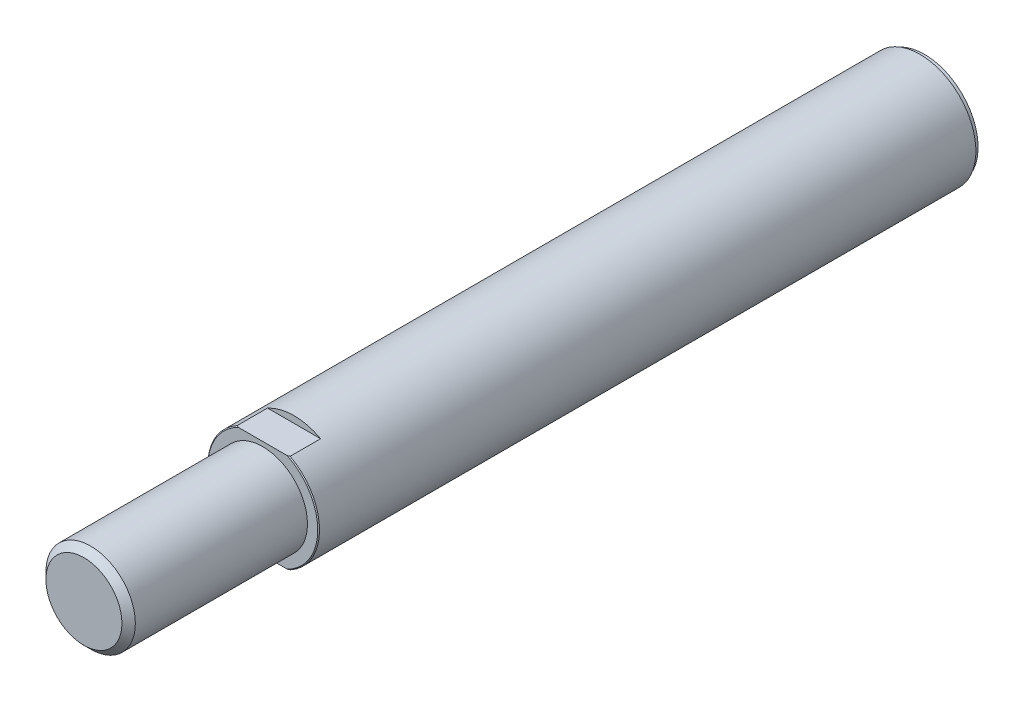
ISO-10303-21;
HEADER;
FILE_DESCRIPTION(('STEP AP214'),'2;1');
FILE_NAME('part.step','',(''),(''),'','','');
FILE_SCHEMA(('AUTOMOTIVE_DESIGN { 1 0 10303 214 1 1 1 1 }'));
ENDSEC;
DATA;
#1=APPLICATION_CONTEXT('core data for automotive mechanical design processes');
#2=APPLICATION_PROTOCOL_DEFINITION('international standard','automotive_design',2000,#1);
#3=PRODUCT_CONTEXT('',#1,'mechanical');
#4=PRODUCT('Part','Part','',(#3));
#5=PRODUCT_RELATED_PRODUCT_CATEGORY('part','',(#4));
#6=PRODUCT_DEFINITION_FORMATION('','',#4);
#7=PRODUCT_DEFINITION_CONTEXT('part definition',#1,'design');
#8=PRODUCT_DEFINITION('design','',#6,#7);
#9=PRODUCT_DEFINITION_SHAPE('','',#8);
#10=(LENGTH_UNIT() NAMED_UNIT(*) SI_UNIT(.MILLI.,.METRE.));
#11=(NAMED_UNIT(*) PLANE_ANGLE_UNIT() SI_UNIT($,.RADIAN.));
#12=(NAMED_UNIT(*) SI_UNIT($,.STERADIAN.) SOLID_ANGLE_UNIT());
#13=UNCERTAINTY_MEASURE_WITH_UNIT(LENGTH_MEASURE(1.E-05),#10,'distance_accuracy_value','');
#14=(GEOMETRIC_REPRESENTATION_CONTEXT(3) GLOBAL_UNCERTAINTY_ASSIGNED_CONTEXT((#13)) GLOBAL_UNIT_ASSIGNED_CONTEXT((#10,
#11,#12)) REPRESENTATION_CONTEXT('',''));
#15=CARTESIAN_POINT('',(0.,0.,0.));
#16=DIRECTION('',(0.,0.,1.));
#17=DIRECTION('',(1.,0.,0.));
#18=AXIS2_PLACEMENT_3D('',#15,#16,#17);
#19=CARTESIAN_POINT('',(0.,0.,188.));
#20=DIRECTION('',(0.,0.,-1.));
#21=DIRECTION('',(-1.,0.,0.));
#22=AXIS2_PLACEMENT_3D('',#19,#20,#21);
#23=CYLINDRICAL_SURFACE('',#22,12.5);
#24=DIRECTION('',(0.,0.,-1.));
#25=VECTOR('',#24,1.);
#26=CARTESIAN_POINT('',(-5.93717104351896,-11.,188.));
#27=LINE('',#26,#25);
#28=CARTESIAN_POINT('',(-5.93717104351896,-11.,147.8));
#29=VERTEX_POINT('',#28);
#30=CARTESIAN_POINT('',(-5.93717104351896,-11.,141.));
#31=VERTEX_POINT('',#30);
#32=EDGE_CURVE('E134',#29,#31,#27,.T.);
#33=ORIENTED_EDGE('',*,*,#32,.F.);
#34=CARTESIAN_POINT('',(0.,0.,147.8));
#35=DIRECTION('',(0.,0.,1.));
#36=DIRECTION('',(1.,0.,0.));
#37=AXIS2_PLACEMENT_3D('',#34,#35,#36);
#38=CIRCLE('',#37,12.5);
#39=CARTESIAN_POINT('',(-5.93717104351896,11.,147.8));
#40=VERTEX_POINT('',#39);
#41=EDGE_CURVE('E146',#29,#40,#38,.F.);
#42=ORIENTED_EDGE('',*,*,#41,.T.);
#43=DIRECTION('',(0.,0.,-1.));
#44=VECTOR('',#43,1.);
#45=CARTESIAN_POINT('',(-5.93717104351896,11.,188.));
#46=LINE('',#45,#44);
#47=CARTESIAN_POINT('',(-5.93717104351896,11.,141.));
#48=VERTEX_POINT('',#47);
#49=EDGE_CURVE('E58',#48,#40,#46,.F.);
#50=ORIENTED_EDGE('',*,*,#49,.F.);
#51=CARTESIAN_POINT('',(0.,0.,141.));
#52=DIRECTION('',(0.,0.,1.));
#53=DIRECTION('',(1.,0.,0.));
#54=AXIS2_PLACEMENT_3D('',#51,#52,#53);
#55=CIRCLE('',#54,12.5);
#56=CARTESIAN_POINT('',(5.93717104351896,11.,141.));
#57=VERTEX_POINT('',#56);
#58=EDGE_CURVE('E329',#57,#48,#55,.T.);
#59=ORIENTED_EDGE('',*,*,#58,.F.);
#60=DIRECTION('',(0.,0.,-1.));
#61=VECTOR('',#60,1.);
#62=CARTESIAN_POINT('',(5.93717104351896,11.,188.));
#63=LINE('',#62,#61);
#64=CARTESIAN_POINT('',(5.93717104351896,11.,147.8));
#65=VERTEX_POINT('',#64);
#66=EDGE_CURVE('E131',#65,#57,#63,.T.);
#67=ORIENTED_EDGE('',*,*,#66,.F.);
#68=CARTESIAN_POINT('',(5.93717104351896,-11.,147.8));
#69=VERTEX_POINT('',#68);
#70=EDGE_CURVE('E143',#65,#69,#38,.F.);
#71=ORIENTED_EDGE('',*,*,#70,.T.);
#72=DIRECTION('',(0.,0.,-1.));
#73=VECTOR('',#72,1.);
#74=CARTESIAN_POINT('',(5.93717104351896,-11.,188.));
#75=LINE('',#74,#73);
#76=CARTESIAN_POINT('',(5.93717104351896,-11.,141.));
#77=VERTEX_POINT('',#76);
#78=EDGE_CURVE('E66',#77,#69,#75,.F.);
#79=ORIENTED_EDGE('',*,*,#78,.F.);
#80=EDGE_CURVE('E332',#31,#77,#55,.T.);
#81=ORIENTED_EDGE('',*,*,#80,.F.);
#82=EDGE_LOOP('',(#33,#42,#50,#59,#67,#71,#79,#81));
#83=FACE_BOUND('',#82,.T.);
#84=CARTESIAN_POINT('',(0.,0.,1.));
#85=DIRECTION('',(0.,0.,-1.));
#86=DIRECTION('',(-1.,0.,0.));
#87=AXIS2_PLACEMENT_3D('',#84,#85,#86);
#88=CIRCLE('',#87,12.5);
#89=CARTESIAN_POINT('',(-12.5,0.,1.));
#90=VERTEX_POINT('',#89);
#91=EDGE_CURVE('E46',#90,#90,#88,.T.);
#92=ORIENTED_EDGE('',*,*,#91,.F.);
#93=EDGE_LOOP('',(#92));
#94=FACE_BOUND('',#93,.T.);
#95=ADVANCED_FACE('F42',(#83,#94),#23,.T.);
#96=CARTESIAN_POINT('',(0.,0.,148.));
#97=DIRECTION('',(0.,0.,1.));
#98=DIRECTION('',(1.,0.,0.));
#99=AXIS2_PLACEMENT_3D('',#96,#97,#98);
#100=PLANE('',#99);
#101=CARTESIAN_POINT('',(0.,0.,148.));
#102=DIRECTION('',(0.,0.,1.));
#103=DIRECTION('',(1.,0.,0.));
#104=AXIS2_PLACEMENT_3D('',#101,#102,#103);
#105=CIRCLE('',#104,10.);
#106=CARTESIAN_POINT('',(10.,0.,148.));
#107=VERTEX_POINT('',#106);
#108=EDGE_CURVE('E136',#107,#107,#105,.T.);
#109=ORIENTED_EDGE('',*,*,#108,.F.);
#110=EDGE_LOOP('',(#109));
#111=FACE_BOUND('',#110,.T.);
#112=CARTESIAN_POINT('',(0.,0.,148.));
#113=DIRECTION('',(0.,0.,1.));
#114=DIRECTION('',(1.,0.,0.));
#115=AXIS2_PLACEMENT_3D('',#112,#113,#114);
#116=CIRCLE('',#115,12.3);
#117=CARTESIAN_POINT('',(-5.50363516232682,11.,148.));
#118=VERTEX_POINT('',#117);
#119=CARTESIAN_POINT('',(-5.50363516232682,-11.,148.));
#120=VERTEX_POINT('',#119);
#121=EDGE_CURVE('E142',#118,#120,#116,.T.);
#122=ORIENTED_EDGE('',*,*,#121,.T.);
#123=DIRECTION('',(1.,0.,0.));
#124=VECTOR('',#123,1.);
#125=CARTESIAN_POINT('',(-18.9676132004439,-11.,148.));
#126=LINE('',#125,#124);
#127=CARTESIAN_POINT('',(5.50363516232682,-11.,148.));
#128=VERTEX_POINT('',#127);
#129=EDGE_CURVE('E123',#120,#128,#126,.T.);
#130=ORIENTED_EDGE('',*,*,#129,.T.);
#131=CARTESIAN_POINT('',(5.50363516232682,11.,148.));
#132=VERTEX_POINT('',#131);
#133=EDGE_CURVE('E139',#128,#132,#116,.T.);
#134=ORIENTED_EDGE('',*,*,#133,.T.);
#135=DIRECTION('',(-1.,0.,0.));
#136=VECTOR('',#135,1.);
#137=CARTESIAN_POINT('',(-18.9676132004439,11.,148.));
#138=LINE('',#137,#136);
#139=EDGE_CURVE('E125',#132,#118,#138,.T.);
#140=ORIENTED_EDGE('',*,*,#139,.T.);
#141=EDGE_LOOP('',(#122,#130,#134,#140));
#142=FACE_BOUND('',#141,.T.);
#143=ADVANCED_FACE('F183',(#111,#142),#100,.T.);
#144=CARTESIAN_POINT('',(0.,0.,148.));
#145=DIRECTION('',(0.,0.,-1.));
#146=DIRECTION('',(-1.,0.,0.));
#147=AXIS2_PLACEMENT_3D('',#144,#145,#146);
#148=CONICAL_SURFACE('',#147,12.3,0.785398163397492);
#149=ORIENTED_EDGE('',*,*,#41,.F.);
#150=CARTESIAN_POINT('',(-25.2049082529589,-11.,132.79932000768));
#151=CARTESIAN_POINT('',(-24.8332961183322,-11.,133.139899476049));
#152=CARTESIAN_POINT('',(-24.4610927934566,-11.,133.479835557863));
#153=CARTESIAN_POINT('',(-23.7153278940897,-11.,134.158220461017));
#154=CARTESIAN_POINT('',(-23.3417663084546,-11.,134.496669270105));
#155=CARTESIAN_POINT('',(-22.5930262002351,-11.,135.1719537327));
#156=CARTESIAN_POINT('',(-22.2178473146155,-11.,135.508788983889));
#157=CARTESIAN_POINT('',(-21.4657494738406,-11.,136.18051046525));
#158=CARTESIAN_POINT('',(-21.0888305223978,-11.,136.515396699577));
#159=CARTESIAN_POINT('',(-20.3305063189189,-11.,137.185120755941));
#160=CARTESIAN_POINT('',(-19.9490878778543,-11.,137.519943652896));
#161=CARTESIAN_POINT('',(-19.1839299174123,-11.,138.186926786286));
#162=CARTESIAN_POINT('',(-18.8001904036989,-11.,138.519087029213));
#163=CARTESIAN_POINT('',(-18.0300668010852,-11.,139.180238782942));
#164=CARTESIAN_POINT('',(-17.6436830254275,-11.,139.509230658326));
#165=CARTESIAN_POINT('',(-16.8677829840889,-11.,140.163501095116));
#166=CARTESIAN_POINT('',(-16.4782667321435,-11.,140.488779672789));
#167=CARTESIAN_POINT('',(-15.7614675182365,-11.,141.080475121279));
#168=CARTESIAN_POINT('',(-15.4347519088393,-11.,141.347578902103));
#169=CARTESIAN_POINT('',(-14.7783997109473,-11.,141.878171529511));
#170=CARTESIAN_POINT('',(-14.4487631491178,-11.,142.14166040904));
#171=CARTESIAN_POINT('',(-13.7860202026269,-11.,142.664443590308));
#172=CARTESIAN_POINT('',(-13.4529128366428,-11.,142.923736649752));
#173=CARTESIAN_POINT('',(-12.7827870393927,-11.,143.43722206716));
#174=CARTESIAN_POINT('',(-12.4457686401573,-11.,143.69141446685));
#175=CARTESIAN_POINT('',(-11.7675925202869,-11.,144.193346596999));
#176=CARTESIAN_POINT('',(-11.4264404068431,-11.,144.441093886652));
#177=CARTESIAN_POINT('',(-10.7388110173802,-11.,144.929138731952));
#178=CARTESIAN_POINT('',(-10.3923335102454,-11.,145.169435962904));
#179=CARTESIAN_POINT('',(-9.69333013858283,-11.,145.640735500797));
#180=CARTESIAN_POINT('',(-9.34080722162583,-11.,145.871742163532));
#181=CARTESIAN_POINT('',(-8.62854944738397,-11.,146.322311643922));
#182=CARTESIAN_POINT('',(-8.26881550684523,-11.,146.541875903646));
#183=CARTESIAN_POINT('',(-7.54622405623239,-11.,146.963558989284));
#184=CARTESIAN_POINT('',(-7.18348838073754,-11.,147.165885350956));
#185=CARTESIAN_POINT('',(-6.44862768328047,-11.,147.552951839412));
#186=CARTESIAN_POINT('',(-6.07650171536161,-11.,147.737690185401));
#187=CARTESIAN_POINT('',(-5.32234700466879,-11.,148.084623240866));
#188=CARTESIAN_POINT('',(-4.94033118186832,-11.,148.246845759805));
#189=CARTESIAN_POINT('',(-4.16548005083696,-11.,148.543160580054));
#190=CARTESIAN_POINT('',(-3.77264786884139,-11.,148.677260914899));
#191=CARTESIAN_POINT('',(-3.05749092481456,-11.,148.887010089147));
#192=CARTESIAN_POINT('',(-2.73703620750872,-11.,148.968998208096));
#193=CARTESIAN_POINT('',(-2.09063675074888,-11.,149.107537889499));
#194=CARTESIAN_POINT('',(-1.76469277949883,-11.,149.164092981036));
#195=CARTESIAN_POINT('',(-1.1099433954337,-11.,149.248894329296));
#196=CARTESIAN_POINT('',(-0.781147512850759,-11.,149.277213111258));
#197=CARTESIAN_POINT('',(-0.122326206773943,-11.,149.30424323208));
#198=CARTESIAN_POINT('',(0.207699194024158,-11.,149.302955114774));
#199=CARTESIAN_POINT('',(0.866187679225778,-11.,149.270850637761));
#200=CARTESIAN_POINT('',(1.19465120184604,-11.,149.240043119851));
#201=CARTESIAN_POINT('',(1.84773423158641,-11.,149.150587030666));
#202=CARTESIAN_POINT('',(2.17235340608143,-11.,149.091936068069));
#203=CARTESIAN_POINT('',(2.8169274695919,-11.,148.949408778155));
#204=CARTESIAN_POINT('',(3.13686596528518,-11.,148.865459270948));
#205=CARTESIAN_POINT('',(3.77013120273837,-11.,148.675776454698));
#206=CARTESIAN_POINT('',(4.08345803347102,-11.,148.570043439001));
#207=CARTESIAN_POINT('',(4.77959899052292,-11.,148.311847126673));
#208=CARTESIAN_POINT('',(5.16051287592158,-11.,148.154288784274));
#209=CARTESIAN_POINT('',(5.91217216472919,-11.,147.816371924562));
#210=CARTESIAN_POINT('',(6.28291247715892,-11.,147.636002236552));
#211=CARTESIAN_POINT('',(7.01572159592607,-11.,147.256923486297));
#212=CARTESIAN_POINT('',(7.37777248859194,-11.,147.058180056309));
#213=CARTESIAN_POINT('',(8.09354374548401,-11.,146.646436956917));
#214=CARTESIAN_POINT('',(8.44726541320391,-11.,146.433439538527));
#215=CARTESIAN_POINT('',(9.15130038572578,-11.,145.993709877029));
#216=CARTESIAN_POINT('',(9.50153682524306,-11.,145.766855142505));
#217=CARTESIAN_POINT('',(10.1957742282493,-11.,145.303768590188));
#218=CARTESIAN_POINT('',(10.5397746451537,-11.,145.06753595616));
#219=CARTESIAN_POINT('',(11.2225281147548,-11.,144.587386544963));
#220=CARTESIAN_POINT('',(11.5612793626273,-11.,144.343467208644));
#221=CARTESIAN_POINT('',(12.2341678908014,-11.,143.849383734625));
#222=CARTESIAN_POINT('',(12.5683053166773,-11.,143.599219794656));
#223=CARTESIAN_POINT('',(13.4491244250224,-11.,142.928993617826));
#224=CARTESIAN_POINT('',(13.9924028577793,-11.,142.504460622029));
#225=CARTESIAN_POINT('',(15.0704026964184,-11.,141.644933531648));
#226=CARTESIAN_POINT('',(15.6051257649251,-11.,141.209941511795));
#227=CARTESIAN_POINT('',(16.6682135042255,-11.,140.331532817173));
#228=CARTESIAN_POINT('',(17.1965735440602,-11.,139.888110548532));
#229=CARTESIAN_POINT('',(18.2478896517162,-11.,138.99486689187));
#230=CARTESIAN_POINT('',(18.7708454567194,-11.,138.545045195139));
#231=CARTESIAN_POINT('',(19.7911752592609,-11.,137.658678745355));
#232=CARTESIAN_POINT('',(20.2887256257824,-11.,137.222336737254));
#233=CARTESIAN_POINT('',(21.2804238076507,-11.,136.345821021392));
#234=CARTESIAN_POINT('',(21.7745716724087,-11.,135.905647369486));
#235=CARTESIAN_POINT('',(22.7594616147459,-11.,135.022629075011));
#236=CARTESIAN_POINT('',(23.2502069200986,-11.,134.579788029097));
#237=CARTESIAN_POINT('',(24.2292721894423,-11.,133.6914346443));
#238=CARTESIAN_POINT('',(24.7175921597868,-11.,133.245922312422));
#239=CARTESIAN_POINT('',(25.2049082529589,-11.,132.79932000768));
#240=B_SPLINE_CURVE_WITH_KNOTS('',3,(#150,#151,#152,#153,#154,#155,#156,#157,#158,#159,#160,
#161,#162,#163,#164,#165,#166,#167,#168,#169,#170,#171,#172,#173,#174,#175,#176,#177,#178,#179,
#180,#181,#182,#183,#184,#185,#186,#187,#188,#189,#190,#191,#192,#193,#194,#195,#196,#197,#198,
#199,#200,#201,#202,#203,#204,#205,#206,#207,#208,#209,#210,#211,#212,#213,#214,#215,#216,#217,
#218,#219,#220,#221,#222,#223,#224,#225,#226,#227,#228,#229,#230,#231,#232,#233,#234,#235,#236,
#237,#238,#239),.UNSPECIFIED.,.F.,.F.,(4,2,2,2,2,2,2,2,2,2,2,2,2,2,2,2,2,2,2,2,2,2,2,2,2,2,2,2,
2,2,2,2,2,2,2,2,2,2,2,2,2,2,2,2,4),(0.,1.51222100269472,3.02445444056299,4.53704712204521,
6.0496365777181,7.57221518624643,9.09479008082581,10.6171876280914,12.1395785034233,
13.4055696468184,14.6715492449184,15.9378970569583,17.2042345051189,18.4690128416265,
19.733846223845,20.9980795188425,22.2621530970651,23.5078130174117,24.7535989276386,
25.9978321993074,27.2417095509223,28.2331520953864,29.2244570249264,30.2132091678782,
31.2019431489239,32.1903810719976,33.1789039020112,34.1703140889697,35.1617109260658,
36.3973752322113,37.6336470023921,38.8722798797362,40.110717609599,41.3623951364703,
42.6141818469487,43.8663898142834,45.1185581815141,47.1867976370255,49.2546301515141,
51.3238862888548,53.3932425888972,55.3785544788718,57.3638374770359,59.346868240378,
61.3298938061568),.UNSPECIFIED.);
#241=EDGE_CURVE('E325',#29,#120,#240,.T.);
#242=ORIENTED_EDGE('',*,*,#241,.T.);
#243=ORIENTED_EDGE('',*,*,#121,.F.);
#244=CARTESIAN_POINT('',(25.2049082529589,11.,132.79932000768));
#245=CARTESIAN_POINT('',(24.8332961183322,11.,133.139899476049));
#246=CARTESIAN_POINT('',(24.4610927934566,11.,133.479835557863));
#247=CARTESIAN_POINT('',(23.7153278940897,11.,134.158220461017));
#248=CARTESIAN_POINT('',(23.3417663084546,11.,134.496669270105));
#249=CARTESIAN_POINT('',(22.5930262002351,11.,135.1719537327));
#250=CARTESIAN_POINT('',(22.2178473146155,11.,135.508788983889));
#251=CARTESIAN_POINT('',(21.4657494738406,11.,136.18051046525));
#252=CARTESIAN_POINT('',(21.0888305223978,11.,136.515396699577));
#253=CARTESIAN_POINT('',(20.3305063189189,11.,137.185120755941));
#254=CARTESIAN_POINT('',(19.9490878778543,11.,137.519943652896));
#255=CARTESIAN_POINT('',(19.1839299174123,11.,138.186926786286));
#256=CARTESIAN_POINT('',(18.8001904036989,11.,138.519087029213));
#257=CARTESIAN_POINT('',(18.0300668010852,11.,139.180238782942));
#258=CARTESIAN_POINT('',(17.6436830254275,11.,139.509230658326));
#259=CARTESIAN_POINT('',(16.8677829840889,11.,140.163501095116));
#260=CARTESIAN_POINT('',(16.4782667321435,11.,140.488779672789));
#261=CARTESIAN_POINT('',(15.7614675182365,11.,141.080475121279));
#262=CARTESIAN_POINT('',(15.4347519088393,11.,141.347578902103));
#263=CARTESIAN_POINT('',(14.7783997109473,11.,141.878171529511));
#264=CARTESIAN_POINT('',(14.4487631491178,11.,142.14166040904));
#265=CARTESIAN_POINT('',(13.7860202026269,11.,142.664443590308));
#266=CARTESIAN_POINT('',(13.4529128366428,11.,142.923736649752));
#267=CARTESIAN_POINT('',(12.7827870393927,11.,143.43722206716));
#268=CARTESIAN_POINT('',(12.4457686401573,11.,143.69141446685));
#269=CARTESIAN_POINT('',(11.7675925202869,11.,144.193346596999));
#270=CARTESIAN_POINT('',(11.4264404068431,11.,144.441093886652));
#271=CARTESIAN_POINT('',(10.7388110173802,11.,144.929138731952));
#272=CARTESIAN_POINT('',(10.3923335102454,11.,145.169435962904));
#273=CARTESIAN_POINT('',(9.69333013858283,11.,145.640735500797));
#274=CARTESIAN_POINT('',(9.34080722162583,11.,145.871742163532));
#275=CARTESIAN_POINT('',(8.62854944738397,11.,146.322311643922));
#276=CARTESIAN_POINT('',(8.26881550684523,11.,146.541875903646));
#277=CARTESIAN_POINT('',(7.54622405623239,11.,146.963558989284));
#278=CARTESIAN_POINT('',(7.18348838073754,11.,147.165885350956));
#279=CARTESIAN_POINT('',(6.44862768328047,11.,147.552951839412));
#280=CARTESIAN_POINT('',(6.07650171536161,11.,147.737690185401));
#281=CARTESIAN_POINT('',(5.32234700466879,11.,148.084623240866));
#282=CARTESIAN_POINT('',(4.94033118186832,11.,148.246845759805));
#283=CARTESIAN_POINT('',(4.16548005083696,11.,148.543160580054));
#284=CARTESIAN_POINT('',(3.77264786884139,11.,148.677260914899));
#285=CARTESIAN_POINT('',(3.05749092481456,11.,148.887010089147));
#286=CARTESIAN_POINT('',(2.73703620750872,11.,148.968998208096));
#287=CARTESIAN_POINT('',(2.09063675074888,11.,149.107537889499));
#288=CARTESIAN_POINT('',(1.76469277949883,11.,149.164092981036));
#289=CARTESIAN_POINT('',(1.1099433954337,11.,149.248894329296));
#290=CARTESIAN_POINT('',(0.781147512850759,11.,149.277213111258));
#291=CARTESIAN_POINT('',(0.122326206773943,11.,149.30424323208));
#292=CARTESIAN_POINT('',(-0.207699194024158,11.,149.302955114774));
#293=CARTESIAN_POINT('',(-0.866187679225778,11.,149.270850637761));
#294=CARTESIAN_POINT('',(-1.19465120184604,11.,149.240043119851));
#295=CARTESIAN_POINT('',(-1.84773423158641,11.,149.150587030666));
#296=CARTESIAN_POINT('',(-2.17235340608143,11.,149.091936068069));
#297=CARTESIAN_POINT('',(-2.8169274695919,11.,148.949408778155));
#298=CARTESIAN_POINT('',(-3.13686596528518,11.,148.865459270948));
#299=CARTESIAN_POINT('',(-3.77013120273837,11.,148.675776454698));
#300=CARTESIAN_POINT('',(-4.08345803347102,11.,148.570043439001));
#301=CARTESIAN_POINT('',(-4.77959899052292,11.,148.311847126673));
#302=CARTESIAN_POINT('',(-5.16051287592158,11.,148.154288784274));
#303=CARTESIAN_POINT('',(-5.91217216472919,11.,147.816371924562));
#304=CARTESIAN_POINT('',(-6.28291247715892,11.,147.636002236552));
#305=CARTESIAN_POINT('',(-7.01572159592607,11.,147.256923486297));
#306=CARTESIAN_POINT('',(-7.37777248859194,11.,147.058180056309));
#307=CARTESIAN_POINT('',(-8.09354374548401,11.,146.646436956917));
#308=CARTESIAN_POINT('',(-8.44726541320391,11.,146.433439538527));
#309=CARTESIAN_POINT('',(-9.15130038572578,11.,145.993709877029));
#310=CARTESIAN_POINT('',(-9.50153682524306,11.,145.766855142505));
#311=CARTESIAN_POINT('',(-10.1957742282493,11.,145.303768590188));
#312=CARTESIAN_POINT('',(-10.5397746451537,11.,145.06753595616));
#313=CARTESIAN_POINT('',(-11.2225281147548,11.,144.587386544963));
#314=CARTESIAN_POINT('',(-11.5612793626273,11.,144.343467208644));
#315=CARTESIAN_POINT('',(-12.2341678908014,11.,143.849383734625));
#316=CARTESIAN_POINT('',(-12.5683053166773,11.,143.599219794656));
#317=CARTESIAN_POINT('',(-13.4491244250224,11.,142.928993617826));
#318=CARTESIAN_POINT('',(-13.9924028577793,11.,142.504460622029));
#319=CARTESIAN_POINT('',(-15.0704026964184,11.,141.644933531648));
#320=CARTESIAN_POINT('',(-15.6051257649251,11.,141.209941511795));
#321=CARTESIAN_POINT('',(-16.6682135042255,11.,140.331532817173));
#322=CARTESIAN_POINT('',(-17.1965735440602,11.,139.888110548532));
#323=CARTESIAN_POINT('',(-18.2478896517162,11.,138.99486689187));
#324=CARTESIAN_POINT('',(-18.7708454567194,11.,138.545045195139));
#325=CARTESIAN_POINT('',(-19.7911752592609,11.,137.658678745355));
#326=CARTESIAN_POINT('',(-20.2887256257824,11.,137.222336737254));
#327=CARTESIAN_POINT('',(-21.2804238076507,11.,136.345821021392));
#328=CARTESIAN_POINT('',(-21.7745716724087,11.,135.905647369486));
#329=CARTESIAN_POINT('',(-22.7594616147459,11.,135.022629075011));
#330=CARTESIAN_POINT('',(-23.2502069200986,11.,134.579788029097));
#331=CARTESIAN_POINT('',(-24.2292721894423,11.,133.6914346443));
#332=CARTESIAN_POINT('',(-24.7175921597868,11.,133.245922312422));
#333=CARTESIAN_POINT('',(-25.2049082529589,11.,132.79932000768));
#334=B_SPLINE_CURVE_WITH_KNOTS('',3,(#244,#245,#246,#247,#248,#249,#250,#251,#252,#253,#254,
#255,#256,#257,#258,#259,#260,#261,#262,#263,#264,#265,#266,#267,#268,#269,#270,#271,#272,#273,
#274,#275,#276,#277,#278,#279,#280,#281,#282,#283,#284,#285,#286,#287,#288,#289,#290,#291,#292,
#293,#294,#295,#296,#297,#298,#299,#300,#301,#302,#303,#304,#305,#306,#307,#308,#309,#310,#311,
#312,#313,#314,#315,#316,#317,#318,#319,#320,#321,#322,#323,#324,#325,#326,#327,#328,#329,#330,
#331,#332,#333),.UNSPECIFIED.,.F.,.F.,(4,2,2,2,2,2,2,2,2,2,2,2,2,2,2,2,2,2,2,2,2,2,2,2,2,2,2,2,
2,2,2,2,2,2,2,2,2,2,2,2,2,2,2,2,4),(0.,1.51222100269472,3.02445444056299,4.53704712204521,
6.0496365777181,7.57221518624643,9.09479008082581,10.6171876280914,12.1395785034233,
13.4055696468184,14.6715492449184,15.9378970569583,17.2042345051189,18.4690128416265,
19.733846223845,20.9980795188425,22.2621530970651,23.5078130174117,24.7535989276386,
25.9978321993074,27.2417095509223,28.2331520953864,29.2244570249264,30.2132091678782,
31.2019431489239,32.1903810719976,33.1789039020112,34.1703140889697,35.1617109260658,
36.3973752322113,37.6336470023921,38.8722798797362,40.110717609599,41.3623951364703,
42.6141818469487,43.8663898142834,45.1185581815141,47.1867976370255,49.2546301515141,
51.3238862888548,53.3932425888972,55.3785544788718,57.3638374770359,59.346868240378,
61.3298938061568),.UNSPECIFIED.);
#335=EDGE_CURVE('E147',#118,#40,#334,.T.);
#336=ORIENTED_EDGE('',*,*,#335,.T.);
#337=EDGE_LOOP('',(#149,#242,#243,#336));
#338=FACE_BOUND('',#337,.T.);
#339=ADVANCED_FACE('F162',(#338),#148,.T.);
#340=ORIENTED_EDGE('',*,*,#133,.F.);
#341=EDGE_CURVE('E155',#128,#69,#240,.T.);
#342=ORIENTED_EDGE('',*,*,#341,.T.);
#343=ORIENTED_EDGE('',*,*,#70,.F.);
#344=EDGE_CURVE('E154',#65,#132,#334,.T.);
#345=ORIENTED_EDGE('',*,*,#344,.T.);
#346=EDGE_LOOP('',(#340,#342,#343,#345));
#347=FACE_BOUND('',#346,.T.);
#348=ADVANCED_FACE('F181',(#347),#148,.T.);
#349=CARTESIAN_POINT('',(0.,0.,148.));
#350=DIRECTION('',(0.,0.,1.));
#351=DIRECTION('',(1.,0.,0.));
#352=AXIS2_PLACEMENT_3D('',#349,#350,#351);
#353=CYLINDRICAL_SURFACE('',#352,10.);
#354=CARTESIAN_POINT('',(0.,0.,186.5));
#355=DIRECTION('',(0.,0.,1.));
#356=DIRECTION('',(1.,0.,0.));
#357=AXIS2_PLACEMENT_3D('',#354,#355,#356);
#358=CIRCLE('',#357,10.);
#359=CARTESIAN_POINT('',(10.,0.,186.5));
#360=VERTEX_POINT('',#359);
#361=EDGE_CURVE('E12',#360,#360,#358,.F.);
#362=ORIENTED_EDGE('',*,*,#361,.T.);
#363=EDGE_LOOP('',(#362));
#364=FACE_BOUND('',#363,.T.);
#365=ORIENTED_EDGE('',*,*,#108,.T.);
#366=EDGE_LOOP('',(#365));
#367=FACE_BOUND('',#366,.T.);
#368=ADVANCED_FACE('F178',(#364,#367),#353,.T.);
#369=CARTESIAN_POINT('',(0.,0.,188.));
#370=DIRECTION('',(0.,0.,1.));
#371=DIRECTION('',(1.,0.,0.));
#372=AXIS2_PLACEMENT_3D('',#369,#370,#371);
#373=PLANE('',#372);
#374=CARTESIAN_POINT('',(0.,0.,188.));
#375=DIRECTION('',(0.,0.,1.));
#376=DIRECTION('',(1.,0.,0.));
#377=AXIS2_PLACEMENT_3D('',#374,#375,#376);
#378=CIRCLE('',#377,8.50000000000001);
#379=CARTESIAN_POINT('',(8.50000000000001,0.,188.));
#380=VERTEX_POINT('',#379);
#381=EDGE_CURVE('E51',#380,#380,#378,.T.);
#382=ORIENTED_EDGE('',*,*,#381,.T.);
#383=EDGE_LOOP('',(#382));
#384=FACE_BOUND('',#383,.T.);
#385=ADVANCED_FACE('F170',(#384),#373,.T.);
#386=CARTESIAN_POINT('',(-18.9676132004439,11.,141.));
#387=DIRECTION('',(0.,1.,0.));
#388=DIRECTION('',(0.,0.,1.));
#389=AXIS2_PLACEMENT_3D('',#386,#387,#388);
#390=PLANE('',#389);
#391=ORIENTED_EDGE('',*,*,#66,.T.);
#392=DIRECTION('',(-1.,0.,0.));
#393=VECTOR('',#392,1.);
#394=CARTESIAN_POINT('',(-18.9676132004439,11.,141.));
#395=LINE('',#394,#393);
#396=EDGE_CURVE('E120',#57,#48,#395,.T.);
#397=ORIENTED_EDGE('',*,*,#396,.T.);
#398=ORIENTED_EDGE('',*,*,#49,.T.);
#399=ORIENTED_EDGE('',*,*,#335,.F.);
#400=ORIENTED_EDGE('',*,*,#139,.F.);
#401=ORIENTED_EDGE('',*,*,#344,.F.);
#402=EDGE_LOOP('',(#391,#397,#398,#399,#400,#401));
#403=FACE_BOUND('',#402,.T.);
#404=ADVANCED_FACE('F165',(#403),#390,.T.);
#405=CARTESIAN_POINT('',(0.,0.,141.));
#406=DIRECTION('',(0.,0.,1.));
#407=DIRECTION('',(1.,0.,0.));
#408=AXIS2_PLACEMENT_3D('',#405,#406,#407);
#409=PLANE('',#408);
#410=ORIENTED_EDGE('',*,*,#58,.T.);
#411=ORIENTED_EDGE('',*,*,#396,.F.);
#412=EDGE_LOOP('',(#410,#411));
#413=FACE_BOUND('',#412,.T.);
#414=ADVANCED_FACE('F169',(#413),#409,.T.);
#415=ORIENTED_EDGE('',*,*,#80,.T.);
#416=DIRECTION('',(1.,0.,0.));
#417=VECTOR('',#416,1.);
#418=CARTESIAN_POINT('',(-18.9676132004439,-11.,141.));
#419=LINE('',#418,#417);
#420=EDGE_CURVE('E122',#31,#77,#419,.T.);
#421=ORIENTED_EDGE('',*,*,#420,.F.);
#422=EDGE_LOOP('',(#415,#421));
#423=FACE_BOUND('',#422,.T.);
#424=ADVANCED_FACE('F176',(#423),#409,.T.);
#425=CARTESIAN_POINT('',(-18.9676132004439,-11.,141.));
#426=DIRECTION('',(0.,-1.,0.));
#427=DIRECTION('',(0.,0.,-1.));
#428=AXIS2_PLACEMENT_3D('',#425,#426,#427);
#429=PLANE('',#428);
#430=ORIENTED_EDGE('',*,*,#32,.T.);
#431=ORIENTED_EDGE('',*,*,#420,.T.);
#432=ORIENTED_EDGE('',*,*,#78,.T.);
#433=ORIENTED_EDGE('',*,*,#341,.F.);
#434=ORIENTED_EDGE('',*,*,#129,.F.);
#435=ORIENTED_EDGE('',*,*,#241,.F.);
#436=EDGE_LOOP('',(#430,#431,#432,#433,#434,#435));
#437=FACE_BOUND('',#436,.T.);
#438=ADVANCED_FACE('F171',(#437),#429,.T.);
#439=CARTESIAN_POINT('',(0.,0.,188.));
#440=DIRECTION('',(0.,0.,-1.));
#441=DIRECTION('',(-1.,0.,0.));
#442=AXIS2_PLACEMENT_3D('',#439,#440,#441);
#443=CONICAL_SURFACE('',#442,8.50000000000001,0.785398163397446);
#444=ORIENTED_EDGE('',*,*,#361,.F.);
#445=EDGE_LOOP('',(#444));
#446=FACE_BOUND('',#445,.T.);
#447=ORIENTED_EDGE('',*,*,#381,.F.);
#448=EDGE_LOOP('',(#447));
#449=FACE_BOUND('',#448,.T.);
#450=ADVANCED_FACE('F44',(#446,#449),#443,.T.);
#451=CARTESIAN_POINT('',(0.,0.,1.));
#452=DIRECTION('',(0.,0.,-1.));
#453=DIRECTION('',(-1.,0.,0.));
#454=AXIS2_PLACEMENT_3D('',#451,#452,#453);
#455=PLANE('',#454);
#456=CARTESIAN_POINT('',(0.,0.,1.));
#457=DIRECTION('',(0.,0.,-1.));
#458=DIRECTION('',(-1.,0.,0.));
#459=AXIS2_PLACEMENT_3D('',#456,#457,#458);
#460=CIRCLE('',#459,12.);
#461=CARTESIAN_POINT('',(-12.,0.,1.));
#462=VERTEX_POINT('',#461);
#463=EDGE_CURVE('E113',#462,#462,#460,.T.);
#464=ORIENTED_EDGE('',*,*,#463,.F.);
#465=EDGE_LOOP('',(#464));
#466=FACE_BOUND('',#465,.T.);
#467=ORIENTED_EDGE('',*,*,#91,.T.);
#468=EDGE_LOOP('',(#467));
#469=FACE_BOUND('',#468,.T.);
#470=ADVANCED_FACE('F205',(#466,#469),#455,.T.);
#471=CARTESIAN_POINT('',(0.,0.,1.));
#472=DIRECTION('',(0.,0.,-1.));
#473=DIRECTION('',(-1.,0.,0.));
#474=AXIS2_PLACEMENT_3D('',#471,#472,#473);
#475=CYLINDRICAL_SURFACE('',#474,12.);
#476=ORIENTED_EDGE('',*,*,#463,.T.);
#477=EDGE_LOOP('',(#476));
#478=FACE_BOUND('',#477,.T.);
#479=CARTESIAN_POINT('',(0.,0.,0.));
#480=DIRECTION('',(0.,0.,-1.));
#481=DIRECTION('',(-1.,0.,0.));
#482=AXIS2_PLACEMENT_3D('',#479,#480,#481);
#483=CIRCLE('',#482,12.);
#484=CARTESIAN_POINT('',(-12.,0.,0.));
#485=VERTEX_POINT('',#484);
#486=EDGE_CURVE('E109',#485,#485,#483,.T.);
#487=ORIENTED_EDGE('',*,*,#486,.F.);
#488=EDGE_LOOP('',(#487));
#489=FACE_BOUND('',#488,.T.);
#490=ADVANCED_FACE('F191',(#478,#489),#475,.T.);
#491=CARTESIAN_POINT('',(0.,0.,0.));
#492=DIRECTION('',(0.,0.,1.));
#493=DIRECTION('',(1.,0.,0.));
#494=AXIS2_PLACEMENT_3D('',#491,#492,#493);
#495=PLANE('',#494);
#496=CARTESIAN_POINT('',(0.,0.,0.));
#497=DIRECTION('',(0.,0.,-1.));
#498=DIRECTION('',(-1.,0.,0.));
#499=AXIS2_PLACEMENT_3D('',#496,#497,#498);
#500=CIRCLE('',#499,5.1);
#501=CARTESIAN_POINT('',(-5.1,0.,0.));
#502=VERTEX_POINT('',#501);
#503=EDGE_CURVE('E110',#502,#502,#500,.T.);
#504=ORIENTED_EDGE('',*,*,#503,.F.);
#505=EDGE_LOOP('',(#504));
#506=FACE_BOUND('',#505,.T.);
#507=ORIENTED_EDGE('',*,*,#486,.T.);
#508=EDGE_LOOP('',(#507));
#509=FACE_BOUND('',#508,.T.);
#510=ADVANCED_FACE('F103',(#506,#509),#495,.F.);
#511=CARTESIAN_POINT('',(0.,0.,32.75));
#512=DIRECTION('',(0.,0.,-1.));
#513=DIRECTION('',(-1.,0.,0.));
#514=AXIS2_PLACEMENT_3D('',#511,#512,#513);
#515=CONICAL_SURFACE('',#514,5.09999999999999,1.02974425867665);
#516=CARTESIAN_POINT('',(0.,0.,35.8143891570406));
#517=VERTEX_POINT('',#516);
#518=VERTEX_LOOP('',#517);
#519=FACE_BOUND('',#518,.T.);
#520=CARTESIAN_POINT('',(0.,0.,32.75));
#521=DIRECTION('',(0.,0.,-1.));
#522=DIRECTION('',(-1.,0.,0.));
#523=AXIS2_PLACEMENT_3D('',#520,#521,#522);
#524=CIRCLE('',#523,5.09999999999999);
#525=CARTESIAN_POINT('',(-5.09999999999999,0.,32.75));
#526=VERTEX_POINT('',#525);
#527=EDGE_CURVE('E107',#526,#526,#524,.T.);
#528=ORIENTED_EDGE('',*,*,#527,.T.);
#529=EDGE_LOOP('',(#528));
#530=FACE_BOUND('',#529,.T.);
#531=ADVANCED_FACE('F99',(#519,#530),#515,.F.);
#532=CARTESIAN_POINT('',(0.,0.,0.));
#533=DIRECTION('',(0.,0.,-1.));
#534=DIRECTION('',(-1.,0.,0.));
#535=AXIS2_PLACEMENT_3D('',#532,#533,#534);
#536=CYLINDRICAL_SURFACE('',#535,5.09999999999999);
#537=ORIENTED_EDGE('',*,*,#527,.F.);
#538=EDGE_LOOP('',(#537));
#539=FACE_BOUND('',#538,.T.);
#540=ORIENTED_EDGE('',*,*,#503,.T.);
#541=EDGE_LOOP('',(#540));
#542=FACE_BOUND('',#541,.T.);
#543=ADVANCED_FACE('F102',(#539,#542),#536,.F.);
#544=CLOSED_SHELL('',(#95,#143,#339,#348,#368,#385,#404,#414,#424,#438,#450,#470,#490,#510,#531,#543));
#545=MANIFOLD_SOLID_BREP('B2',#544);
#546=ADVANCED_BREP_SHAPE_REPRESENTATION('',(#18,#545),#14);
#547=SHAPE_DEFINITION_REPRESENTATION(#9,#546);
ENDSEC;
END-ISO-10303-21;
